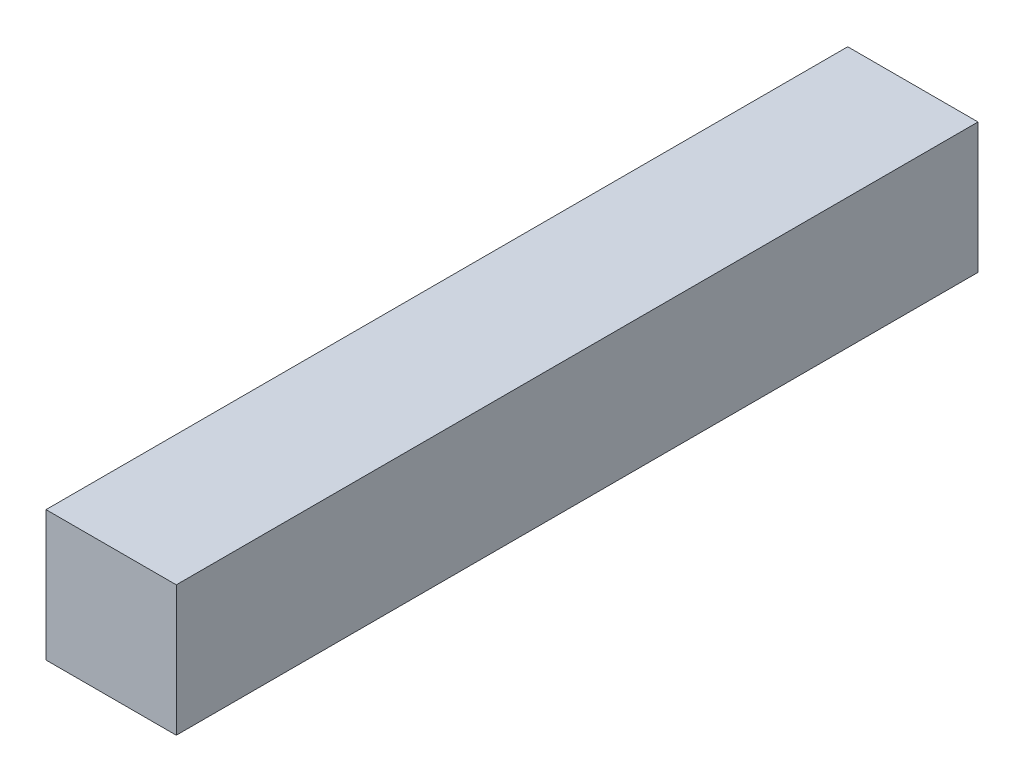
from build123d import *

# Parameters (mm, degrees)
ESQUISSE1_W      = 13
ESQUISSE1_H      = 13
EXTRUSION1_DEPTH = 40


with BuildPart() as part:
    # Esquisse1 → Extrusion1 (new, symmetric)
    with BuildSketch(Plane.XY):
        Rectangle(ESQUISSE1_W, ESQUISSE1_H)
    extrude(amount=EXTRUSION1_DEPTH, both=True)


solid = part.part
